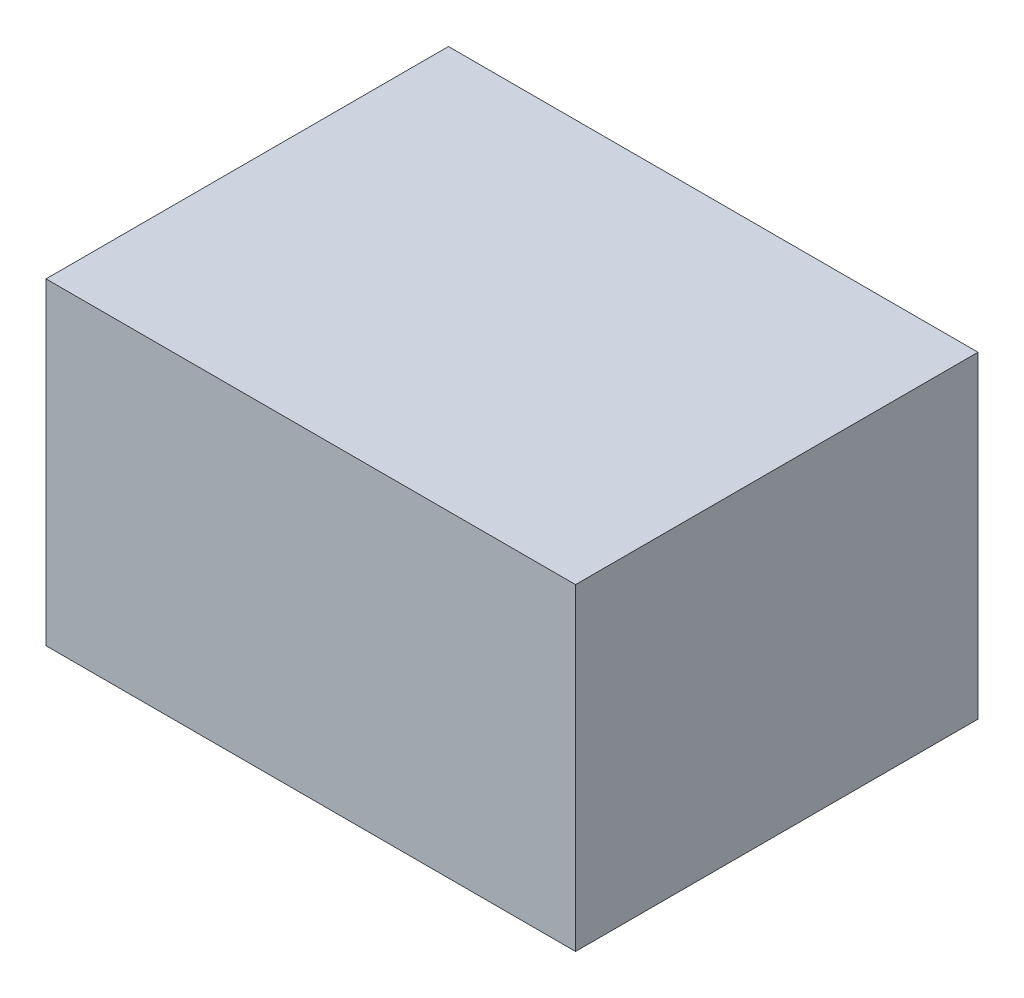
ISO-10303-21;
HEADER;
FILE_DESCRIPTION(('STEP AP214'),'2;1');
FILE_NAME('part.step','',(''),(''),'','','');
FILE_SCHEMA(('AUTOMOTIVE_DESIGN { 1 0 10303 214 1 1 1 1 }'));
ENDSEC;
DATA;
#1=APPLICATION_CONTEXT('core data for automotive mechanical design processes');
#2=APPLICATION_PROTOCOL_DEFINITION('international standard','automotive_design',2000,#1);
#3=PRODUCT_CONTEXT('',#1,'mechanical');
#4=PRODUCT('Part','Part','',(#3));
#5=PRODUCT_RELATED_PRODUCT_CATEGORY('part','',(#4));
#6=PRODUCT_DEFINITION_FORMATION('','',#4);
#7=PRODUCT_DEFINITION_CONTEXT('part definition',#1,'design');
#8=PRODUCT_DEFINITION('design','',#6,#7);
#9=PRODUCT_DEFINITION_SHAPE('','',#8);
#10=(LENGTH_UNIT() NAMED_UNIT(*) SI_UNIT(.MILLI.,.METRE.));
#11=(NAMED_UNIT(*) PLANE_ANGLE_UNIT() SI_UNIT($,.RADIAN.));
#12=(NAMED_UNIT(*) SI_UNIT($,.STERADIAN.) SOLID_ANGLE_UNIT());
#13=UNCERTAINTY_MEASURE_WITH_UNIT(LENGTH_MEASURE(1.E-05),#10,'distance_accuracy_value','');
#14=(GEOMETRIC_REPRESENTATION_CONTEXT(3) GLOBAL_UNCERTAINTY_ASSIGNED_CONTEXT((#13)) GLOBAL_UNIT_ASSIGNED_CONTEXT((#10,
#11,#12)) REPRESENTATION_CONTEXT('',''));
#15=CARTESIAN_POINT('',(0.,0.,0.));
#16=DIRECTION('',(0.,0.,1.));
#17=DIRECTION('',(1.,0.,0.));
#18=AXIS2_PLACEMENT_3D('',#15,#16,#17);
#19=CARTESIAN_POINT('',(6.2500002,-3.75000012,0.));
#20=DIRECTION('',(0.,-1.,0.));
#21=DIRECTION('',(0.,0.,-1.));
#22=AXIS2_PLACEMENT_3D('',#19,#20,#21);
#23=PLANE('',#22);
#24=DIRECTION('',(0.,0.,1.));
#25=VECTOR('',#24,1.);
#26=CARTESIAN_POINT('',(-6.2500002,-3.75000012,0.));
#27=LINE('',#26,#25);
#28=CARTESIAN_POINT('',(-6.2500002,-3.75000012,0.));
#29=VERTEX_POINT('',#28);
#30=CARTESIAN_POINT('',(-6.2500002,-3.75000012,9.5));
#31=VERTEX_POINT('',#30);
#32=EDGE_CURVE('E19',#29,#31,#27,.T.);
#33=ORIENTED_EDGE('',*,*,#32,.F.);
#34=DIRECTION('',(1.,0.,0.));
#35=VECTOR('',#34,1.);
#36=CARTESIAN_POINT('',(-6.2500002,-3.75000012,0.));
#37=LINE('',#36,#35);
#38=CARTESIAN_POINT('',(6.2500002,-3.75000012,0.));
#39=VERTEX_POINT('',#38);
#40=EDGE_CURVE('E78',#29,#39,#37,.T.);
#41=ORIENTED_EDGE('',*,*,#40,.T.);
#42=DIRECTION('',(0.,0.,-1.));
#43=VECTOR('',#42,1.);
#44=CARTESIAN_POINT('',(6.2500002,-3.75000012,0.));
#45=LINE('',#44,#43);
#46=CARTESIAN_POINT('',(6.2500002,-3.75000012,9.5));
#47=VERTEX_POINT('',#46);
#48=EDGE_CURVE('E60',#47,#39,#45,.T.);
#49=ORIENTED_EDGE('',*,*,#48,.F.);
#50=DIRECTION('',(1.,0.,0.));
#51=VECTOR('',#50,1.);
#52=CARTESIAN_POINT('',(-6.2500002,-3.75000012,9.5));
#53=LINE('',#52,#51);
#54=EDGE_CURVE('E55',#31,#47,#53,.T.);
#55=ORIENTED_EDGE('',*,*,#54,.F.);
#56=EDGE_LOOP('',(#33,#41,#49,#55));
#57=FACE_BOUND('',#56,.T.);
#58=ADVANCED_FACE('F16',(#57),#23,.T.);
#59=CARTESIAN_POINT('',(-6.2500002,-3.75000012,0.));
#60=DIRECTION('',(-1.,0.,0.));
#61=DIRECTION('',(0.,0.,1.));
#62=AXIS2_PLACEMENT_3D('',#59,#60,#61);
#63=PLANE('',#62);
#64=DIRECTION('',(0.,0.,1.));
#65=VECTOR('',#64,1.);
#66=CARTESIAN_POINT('',(-6.2500002,3.75000012,0.));
#67=LINE('',#66,#65);
#68=CARTESIAN_POINT('',(-6.2500002,3.75000012,0.));
#69=VERTEX_POINT('',#68);
#70=CARTESIAN_POINT('',(-6.2500002,3.75000012,9.5));
#71=VERTEX_POINT('',#70);
#72=EDGE_CURVE('E82',#69,#71,#67,.T.);
#73=ORIENTED_EDGE('',*,*,#72,.F.);
#74=DIRECTION('',(0.,1.,0.));
#75=VECTOR('',#74,1.);
#76=CARTESIAN_POINT('',(-6.2500002,-3.75000012,0.));
#77=LINE('',#76,#75);
#78=EDGE_CURVE('E67',#69,#29,#77,.F.);
#79=ORIENTED_EDGE('',*,*,#78,.T.);
#80=ORIENTED_EDGE('',*,*,#32,.T.);
#81=DIRECTION('',(0.,1.,0.));
#82=VECTOR('',#81,1.);
#83=CARTESIAN_POINT('',(-6.2500002,-3.75000012,9.5));
#84=LINE('',#83,#82);
#85=EDGE_CURVE('E62',#71,#31,#84,.F.);
#86=ORIENTED_EDGE('',*,*,#85,.F.);
#87=EDGE_LOOP('',(#73,#79,#80,#86));
#88=FACE_BOUND('',#87,.T.);
#89=ADVANCED_FACE('F64',(#88),#63,.T.);
#90=CARTESIAN_POINT('',(-6.2500002,-3.75000012,9.5));
#91=DIRECTION('',(0.,0.,1.));
#92=DIRECTION('',(1.,0.,0.));
#93=AXIS2_PLACEMENT_3D('',#90,#91,#92);
#94=PLANE('',#93);
#95=DIRECTION('',(1.,0.,0.));
#96=VECTOR('',#95,1.);
#97=CARTESIAN_POINT('',(-6.2500002,3.75000012,9.5));
#98=LINE('',#97,#96);
#99=CARTESIAN_POINT('',(6.2500002,3.75000012,9.5));
#100=VERTEX_POINT('',#99);
#101=EDGE_CURVE('E71',#71,#100,#98,.T.);
#102=ORIENTED_EDGE('',*,*,#101,.F.);
#103=ORIENTED_EDGE('',*,*,#85,.T.);
#104=ORIENTED_EDGE('',*,*,#54,.T.);
#105=DIRECTION('',(0.,1.,0.));
#106=VECTOR('',#105,1.);
#107=CARTESIAN_POINT('',(6.2500002,3.75000012,9.5));
#108=LINE('',#107,#106);
#109=EDGE_CURVE('E73',#100,#47,#108,.F.);
#110=ORIENTED_EDGE('',*,*,#109,.F.);
#111=EDGE_LOOP('',(#102,#103,#104,#110));
#112=FACE_BOUND('',#111,.T.);
#113=ADVANCED_FACE('F69',(#112),#94,.T.);
#114=CARTESIAN_POINT('',(6.2500002,3.75000012,0.));
#115=DIRECTION('',(1.,0.,0.));
#116=DIRECTION('',(0.,0.,-1.));
#117=AXIS2_PLACEMENT_3D('',#114,#115,#116);
#118=PLANE('',#117);
#119=ORIENTED_EDGE('',*,*,#48,.T.);
#120=DIRECTION('',(0.,1.,0.));
#121=VECTOR('',#120,1.);
#122=CARTESIAN_POINT('',(6.2500002,-3.75000012,0.));
#123=LINE('',#122,#121);
#124=CARTESIAN_POINT('',(6.2500002,3.75000012,0.));
#125=VERTEX_POINT('',#124);
#126=EDGE_CURVE('E34',#39,#125,#123,.T.);
#127=ORIENTED_EDGE('',*,*,#126,.T.);
#128=DIRECTION('',(0.,0.,1.));
#129=VECTOR('',#128,1.);
#130=CARTESIAN_POINT('',(6.2500002,3.75000012,0.));
#131=LINE('',#130,#129);
#132=EDGE_CURVE('E25',#100,#125,#131,.F.);
#133=ORIENTED_EDGE('',*,*,#132,.F.);
#134=ORIENTED_EDGE('',*,*,#109,.T.);
#135=EDGE_LOOP('',(#119,#127,#133,#134));
#136=FACE_BOUND('',#135,.T.);
#137=ADVANCED_FACE('F88',(#136),#118,.T.);
#138=CARTESIAN_POINT('',(-6.2500002,-3.75000012,0.));
#139=DIRECTION('',(0.,0.,1.));
#140=DIRECTION('',(1.,0.,0.));
#141=AXIS2_PLACEMENT_3D('',#138,#139,#140);
#142=PLANE('',#141);
#143=DIRECTION('',(1.,0.,0.));
#144=VECTOR('',#143,1.);
#145=CARTESIAN_POINT('',(-6.2500002,3.75000012,0.));
#146=LINE('',#145,#144);
#147=EDGE_CURVE('E10',#125,#69,#146,.F.);
#148=ORIENTED_EDGE('',*,*,#147,.F.);
#149=ORIENTED_EDGE('',*,*,#126,.F.);
#150=ORIENTED_EDGE('',*,*,#40,.F.);
#151=ORIENTED_EDGE('',*,*,#78,.F.);
#152=EDGE_LOOP('',(#148,#149,#150,#151));
#153=FACE_BOUND('',#152,.T.);
#154=ADVANCED_FACE('F90',(#153),#142,.F.);
#155=CARTESIAN_POINT('',(-6.2500002,3.75000012,0.));
#156=DIRECTION('',(0.,1.,0.));
#157=DIRECTION('',(0.,0.,1.));
#158=AXIS2_PLACEMENT_3D('',#155,#156,#157);
#159=PLANE('',#158);
#160=ORIENTED_EDGE('',*,*,#132,.T.);
#161=ORIENTED_EDGE('',*,*,#147,.T.);
#162=ORIENTED_EDGE('',*,*,#72,.T.);
#163=ORIENTED_EDGE('',*,*,#101,.T.);
#164=EDGE_LOOP('',(#160,#161,#162,#163));
#165=FACE_BOUND('',#164,.T.);
#166=ADVANCED_FACE('F87',(#165),#159,.T.);
#167=CLOSED_SHELL('',(#58,#89,#113,#137,#154,#166));
#168=MANIFOLD_SOLID_BREP('B1',#167);
#169=ADVANCED_BREP_SHAPE_REPRESENTATION('',(#18,#168),#14);
#170=SHAPE_DEFINITION_REPRESENTATION(#9,#169);
ENDSEC;
END-ISO-10303-21;
